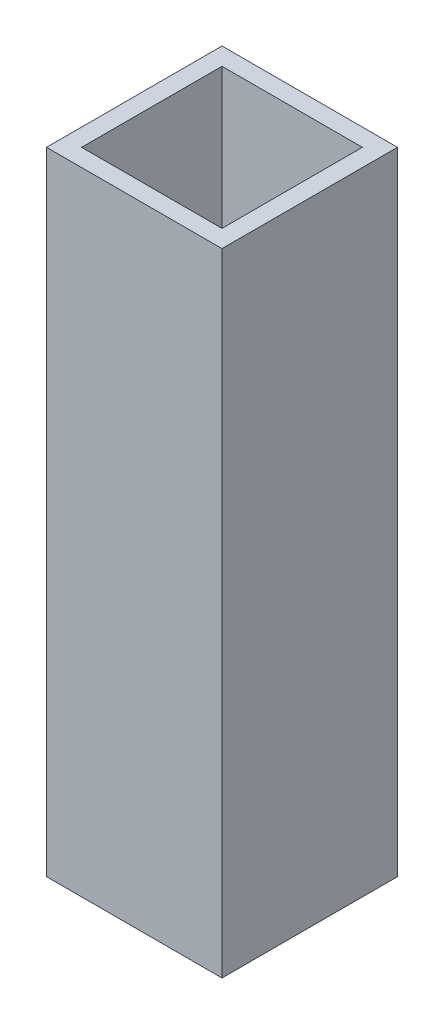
from build123d import *

# Parameters (mm, degrees)
SKETCH_1_W          = 12.5
SKETCH_1_H          = 12.5
EXTRUDE_1_DEPTH     = 45
SKETCH_2_W          = 10
SKETCH_2_H          = 10
CUT_EXTRUDE_1_DEPTH = 42.5


with BuildPart() as part:
    # Sketch 1 → Extrude 1 (new body)
    with BuildSketch(Plane(origin=(0, 0, 0), x_dir=(1, 0, 0), z_dir=(0, 1, 0))):
        Rectangle(SKETCH_1_W, SKETCH_1_H)
    extrude(amount=EXTRUDE_1_DEPTH)

    # Sketch 2 → Cut-Extrude 1 (cut)
    with BuildSketch(Plane(origin=(0, 45, 0), x_dir=(1, 0, 0), z_dir=(0, 1, 0))):
        Rectangle(SKETCH_2_W, SKETCH_2_H)
    extrude(amount=-CUT_EXTRUDE_1_DEPTH, mode=Mode.SUBTRACT)


solid = part.part
